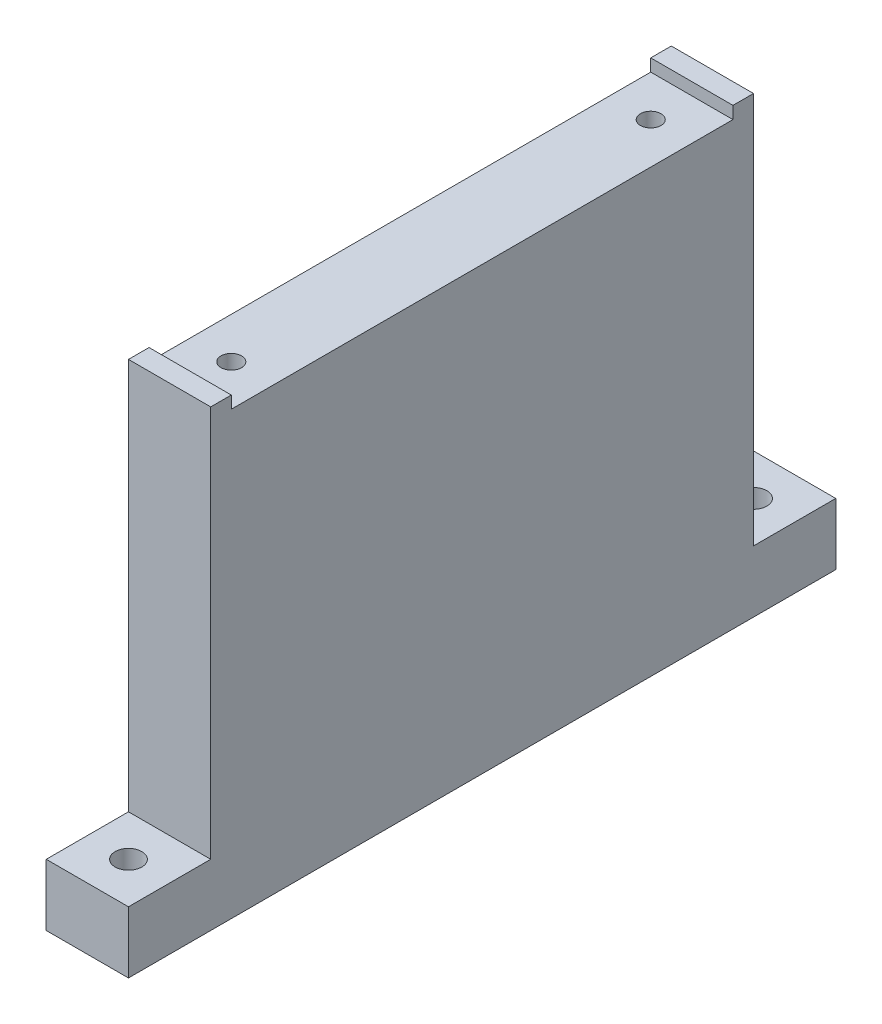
ISO-10303-21;
HEADER;
FILE_DESCRIPTION(('STEP AP214'),'2;1');
FILE_NAME('part.step','',(''),(''),'','','');
FILE_SCHEMA(('AUTOMOTIVE_DESIGN { 1 0 10303 214 1 1 1 1 }'));
ENDSEC;
DATA;
#1=APPLICATION_CONTEXT('core data for automotive mechanical design processes');
#2=APPLICATION_PROTOCOL_DEFINITION('international standard','automotive_design',2000,#1);
#3=PRODUCT_CONTEXT('',#1,'mechanical');
#4=PRODUCT('Part','Part','',(#3));
#5=PRODUCT_RELATED_PRODUCT_CATEGORY('part','',(#4));
#6=PRODUCT_DEFINITION_FORMATION('','',#4);
#7=PRODUCT_DEFINITION_CONTEXT('part definition',#1,'design');
#8=PRODUCT_DEFINITION('design','',#6,#7);
#9=PRODUCT_DEFINITION_SHAPE('','',#8);
#10=(LENGTH_UNIT() NAMED_UNIT(*) SI_UNIT(.MILLI.,.METRE.));
#11=(NAMED_UNIT(*) PLANE_ANGLE_UNIT() SI_UNIT($,.RADIAN.));
#12=(NAMED_UNIT(*) SI_UNIT($,.STERADIAN.) SOLID_ANGLE_UNIT());
#13=UNCERTAINTY_MEASURE_WITH_UNIT(LENGTH_MEASURE(1.E-05),#10,'distance_accuracy_value','');
#14=(GEOMETRIC_REPRESENTATION_CONTEXT(3) GLOBAL_UNCERTAINTY_ASSIGNED_CONTEXT((#13)) GLOBAL_UNIT_ASSIGNED_CONTEXT((#10,
#11,#12)) REPRESENTATION_CONTEXT('',''));
#15=CARTESIAN_POINT('',(0.,0.,0.));
#16=DIRECTION('',(0.,0.,1.));
#17=DIRECTION('',(1.,0.,0.));
#18=AXIS2_PLACEMENT_3D('',#15,#16,#17);
#19=CARTESIAN_POINT('',(20.,0.,172.));
#20=DIRECTION('',(-1.,0.,0.));
#21=DIRECTION('',(0.,0.,1.));
#22=AXIS2_PLACEMENT_3D('',#19,#20,#21);
#23=PLANE('',#22);
#24=DIRECTION('',(0.,1.,0.));
#25=VECTOR('',#24,1.);
#26=CARTESIAN_POINT('',(20.,15.,20.));
#27=LINE('',#26,#25);
#28=CARTESIAN_POINT('',(20.,15.,20.));
#29=VERTEX_POINT('',#28);
#30=CARTESIAN_POINT('',(20.,110.280000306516,20.));
#31=VERTEX_POINT('',#30);
#32=EDGE_CURVE('E224',#29,#31,#27,.T.);
#33=ORIENTED_EDGE('',*,*,#32,.T.);
#34=DIRECTION('',(0.,0.,-1.));
#35=VECTOR('',#34,1.);
#36=CARTESIAN_POINT('',(20.,110.280000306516,172.));
#37=LINE('',#36,#35);
#38=CARTESIAN_POINT('',(20.,110.280000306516,25.));
#39=VERTEX_POINT('',#38);
#40=EDGE_CURVE('E146',#39,#31,#37,.T.);
#41=ORIENTED_EDGE('',*,*,#40,.F.);
#42=DIRECTION('',(0.,-1.,0.));
#43=VECTOR('',#42,1.);
#44=CARTESIAN_POINT('',(20.,107.280000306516,25.));
#45=LINE('',#44,#43);
#46=CARTESIAN_POINT('',(20.,107.280000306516,25.));
#47=VERTEX_POINT('',#46);
#48=EDGE_CURVE('E219',#39,#47,#45,.T.);
#49=ORIENTED_EDGE('',*,*,#48,.T.);
#50=DIRECTION('',(0.,0.,1.));
#51=VECTOR('',#50,1.);
#52=CARTESIAN_POINT('',(20.,107.280000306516,147.));
#53=LINE('',#52,#51);
#54=CARTESIAN_POINT('',(20.,107.280000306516,147.));
#55=VERTEX_POINT('',#54);
#56=EDGE_CURVE('E140',#47,#55,#53,.T.);
#57=ORIENTED_EDGE('',*,*,#56,.T.);
#58=DIRECTION('',(0.,1.,0.));
#59=VECTOR('',#58,1.);
#60=CARTESIAN_POINT('',(20.,107.280000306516,147.));
#61=LINE('',#60,#59);
#62=CARTESIAN_POINT('',(20.,110.280000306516,147.));
#63=VERTEX_POINT('',#62);
#64=EDGE_CURVE('E123',#55,#63,#61,.T.);
#65=ORIENTED_EDGE('',*,*,#64,.T.);
#66=CARTESIAN_POINT('',(20.,110.280000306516,152.));
#67=VERTEX_POINT('',#66);
#68=EDGE_CURVE('E137',#67,#63,#37,.T.);
#69=ORIENTED_EDGE('',*,*,#68,.F.);
#70=DIRECTION('',(0.,-1.,0.));
#71=VECTOR('',#70,1.);
#72=CARTESIAN_POINT('',(20.,15.,152.));
#73=LINE('',#72,#71);
#74=CARTESIAN_POINT('',(20.,15.,152.));
#75=VERTEX_POINT('',#74);
#76=EDGE_CURVE('E141',#67,#75,#73,.T.);
#77=ORIENTED_EDGE('',*,*,#76,.T.);
#78=DIRECTION('',(0.,0.,1.));
#79=VECTOR('',#78,1.);
#80=CARTESIAN_POINT('',(20.,15.,172.));
#81=LINE('',#80,#79);
#82=CARTESIAN_POINT('',(20.,15.,172.));
#83=VERTEX_POINT('',#82);
#84=EDGE_CURVE('E172',#75,#83,#81,.T.);
#85=ORIENTED_EDGE('',*,*,#84,.T.);
#86=DIRECTION('',(0.,1.,0.));
#87=VECTOR('',#86,1.);
#88=CARTESIAN_POINT('',(20.,0.,172.));
#89=LINE('',#88,#87);
#90=CARTESIAN_POINT('',(20.,0.,172.));
#91=VERTEX_POINT('',#90);
#92=EDGE_CURVE('E193',#91,#83,#89,.T.);
#93=ORIENTED_EDGE('',*,*,#92,.F.);
#94=DIRECTION('',(0.,0.,-1.));
#95=VECTOR('',#94,1.);
#96=CARTESIAN_POINT('',(20.,0.,172.));
#97=LINE('',#96,#95);
#98=CARTESIAN_POINT('',(20.,0.,0.));
#99=VERTEX_POINT('',#98);
#100=EDGE_CURVE('E145',#91,#99,#97,.T.);
#101=ORIENTED_EDGE('',*,*,#100,.T.);
#102=DIRECTION('',(0.,1.,0.));
#103=VECTOR('',#102,1.);
#104=CARTESIAN_POINT('',(20.,0.,0.));
#105=LINE('',#104,#103);
#106=CARTESIAN_POINT('',(20.,15.,0.));
#107=VERTEX_POINT('',#106);
#108=EDGE_CURVE('E184',#99,#107,#105,.T.);
#109=ORIENTED_EDGE('',*,*,#108,.T.);
#110=DIRECTION('',(0.,0.,1.));
#111=VECTOR('',#110,1.);
#112=CARTESIAN_POINT('',(20.,15.,20.));
#113=LINE('',#112,#111);
#114=EDGE_CURVE('E226',#107,#29,#113,.T.);
#115=ORIENTED_EDGE('',*,*,#114,.T.);
#116=EDGE_LOOP('',(#33,#41,#49,#57,#65,#69,#77,#85,#93,#101,#109,#115));
#117=FACE_BOUND('',#116,.T.);
#118=ADVANCED_FACE('F33',(#117),#23,.F.);
#119=CARTESIAN_POINT('',(0.,110.280000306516,172.));
#120=DIRECTION('',(0.,-1.,0.));
#121=DIRECTION('',(0.,0.,-1.));
#122=AXIS2_PLACEMENT_3D('',#119,#120,#121);
#123=PLANE('',#122);
#124=DIRECTION('',(1.,0.,0.));
#125=VECTOR('',#124,1.);
#126=CARTESIAN_POINT('',(-152.,110.280000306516,25.));
#127=LINE('',#126,#125);
#128=CARTESIAN_POINT('',(0.,110.280000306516,25.));
#129=VERTEX_POINT('',#128);
#130=EDGE_CURVE('E213',#129,#39,#127,.T.);
#131=ORIENTED_EDGE('',*,*,#130,.T.);
#132=ORIENTED_EDGE('',*,*,#40,.T.);
#133=DIRECTION('',(1.,0.,0.));
#134=VECTOR('',#133,1.);
#135=CARTESIAN_POINT('',(-152.,110.280000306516,20.));
#136=LINE('',#135,#134);
#137=CARTESIAN_POINT('',(0.,110.280000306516,20.));
#138=VERTEX_POINT('',#137);
#139=EDGE_CURVE('E216',#138,#31,#136,.T.);
#140=ORIENTED_EDGE('',*,*,#139,.F.);
#141=DIRECTION('',(0.,0.,-1.));
#142=VECTOR('',#141,1.);
#143=CARTESIAN_POINT('',(0.,110.280000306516,172.));
#144=LINE('',#143,#142);
#145=EDGE_CURVE('E154',#129,#138,#144,.T.);
#146=ORIENTED_EDGE('',*,*,#145,.F.);
#147=EDGE_LOOP('',(#131,#132,#140,#146));
#148=FACE_BOUND('',#147,.T.);
#149=ADVANCED_FACE('F290',(#148),#123,.F.);
#150=DIRECTION('',(1.,0.,0.));
#151=VECTOR('',#150,1.);
#152=CARTESIAN_POINT('',(-152.,110.280000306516,152.));
#153=LINE('',#152,#151);
#154=CARTESIAN_POINT('',(0.,110.280000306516,152.));
#155=VERTEX_POINT('',#154);
#156=EDGE_CURVE('E131',#155,#67,#153,.T.);
#157=ORIENTED_EDGE('',*,*,#156,.T.);
#158=ORIENTED_EDGE('',*,*,#68,.T.);
#159=DIRECTION('',(1.,0.,0.));
#160=VECTOR('',#159,1.);
#161=CARTESIAN_POINT('',(-152.,110.280000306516,147.));
#162=LINE('',#161,#160);
#163=CARTESIAN_POINT('',(0.,110.280000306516,147.));
#164=VERTEX_POINT('',#163);
#165=EDGE_CURVE('E120',#164,#63,#162,.T.);
#166=ORIENTED_EDGE('',*,*,#165,.F.);
#167=EDGE_CURVE('E152',#155,#164,#144,.T.);
#168=ORIENTED_EDGE('',*,*,#167,.F.);
#169=EDGE_LOOP('',(#157,#158,#166,#168));
#170=FACE_BOUND('',#169,.T.);
#171=ADVANCED_FACE('F144',(#170),#123,.F.);
#172=CARTESIAN_POINT('',(0.,0.,172.));
#173=DIRECTION('',(1.,0.,0.));
#174=DIRECTION('',(0.,0.,-1.));
#175=AXIS2_PLACEMENT_3D('',#172,#173,#174);
#176=PLANE('',#175);
#177=DIRECTION('',(0.,1.,0.));
#178=VECTOR('',#177,1.);
#179=CARTESIAN_POINT('',(0.,0.,20.));
#180=LINE('',#179,#178);
#181=CARTESIAN_POINT('',(0.,15.,20.));
#182=VERTEX_POINT('',#181);
#183=EDGE_CURVE('E12',#182,#138,#180,.T.);
#184=ORIENTED_EDGE('',*,*,#183,.F.);
#185=DIRECTION('',(0.,0.,1.));
#186=VECTOR('',#185,1.);
#187=CARTESIAN_POINT('',(0.,15.,172.));
#188=LINE('',#187,#186);
#189=CARTESIAN_POINT('',(0.,15.,0.));
#190=VERTEX_POINT('',#189);
#191=EDGE_CURVE('E181',#190,#182,#188,.T.);
#192=ORIENTED_EDGE('',*,*,#191,.F.);
#193=DIRECTION('',(0.,-1.,0.));
#194=VECTOR('',#193,1.);
#195=CARTESIAN_POINT('',(0.,0.,0.));
#196=LINE('',#195,#194);
#197=CARTESIAN_POINT('',(0.,0.,0.));
#198=VERTEX_POINT('',#197);
#199=EDGE_CURVE('E194',#190,#198,#196,.T.);
#200=ORIENTED_EDGE('',*,*,#199,.T.);
#201=DIRECTION('',(0.,0.,-1.));
#202=VECTOR('',#201,1.);
#203=CARTESIAN_POINT('',(0.,0.,172.));
#204=LINE('',#203,#202);
#205=CARTESIAN_POINT('',(0.,0.,172.));
#206=VERTEX_POINT('',#205);
#207=EDGE_CURVE('E197',#206,#198,#204,.T.);
#208=ORIENTED_EDGE('',*,*,#207,.F.);
#209=DIRECTION('',(0.,-1.,0.));
#210=VECTOR('',#209,1.);
#211=CARTESIAN_POINT('',(0.,0.,172.));
#212=LINE('',#211,#210);
#213=CARTESIAN_POINT('',(0.,15.,172.));
#214=VERTEX_POINT('',#213);
#215=EDGE_CURVE('E179',#214,#206,#212,.T.);
#216=ORIENTED_EDGE('',*,*,#215,.F.);
#217=DIRECTION('',(0.,0.,1.));
#218=VECTOR('',#217,1.);
#219=CARTESIAN_POINT('',(0.,15.,172.));
#220=LINE('',#219,#218);
#221=CARTESIAN_POINT('',(0.,15.,152.));
#222=VERTEX_POINT('',#221);
#223=EDGE_CURVE('E56',#222,#214,#220,.T.);
#224=ORIENTED_EDGE('',*,*,#223,.F.);
#225=DIRECTION('',(0.,-1.,0.));
#226=VECTOR('',#225,1.);
#227=CARTESIAN_POINT('',(0.,0.,152.));
#228=LINE('',#227,#226);
#229=EDGE_CURVE('E41',#155,#222,#228,.T.);
#230=ORIENTED_EDGE('',*,*,#229,.F.);
#231=ORIENTED_EDGE('',*,*,#167,.T.);
#232=DIRECTION('',(0.,1.,0.));
#233=VECTOR('',#232,1.);
#234=CARTESIAN_POINT('',(0.,0.,147.));
#235=LINE('',#234,#233);
#236=CARTESIAN_POINT('',(0.,107.280000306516,147.));
#237=VERTEX_POINT('',#236);
#238=EDGE_CURVE('E126',#237,#164,#235,.T.);
#239=ORIENTED_EDGE('',*,*,#238,.F.);
#240=DIRECTION('',(0.,0.,1.));
#241=VECTOR('',#240,1.);
#242=CARTESIAN_POINT('',(0.,107.280000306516,172.));
#243=LINE('',#242,#241);
#244=CARTESIAN_POINT('',(0.,107.280000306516,25.));
#245=VERTEX_POINT('',#244);
#246=EDGE_CURVE('E161',#245,#237,#243,.T.);
#247=ORIENTED_EDGE('',*,*,#246,.F.);
#248=DIRECTION('',(0.,-1.,0.));
#249=VECTOR('',#248,1.);
#250=CARTESIAN_POINT('',(0.,0.,25.));
#251=LINE('',#250,#249);
#252=EDGE_CURVE('E163',#129,#245,#251,.T.);
#253=ORIENTED_EDGE('',*,*,#252,.F.);
#254=ORIENTED_EDGE('',*,*,#145,.T.);
#255=EDGE_LOOP('',(#184,#192,#200,#208,#216,#224,#230,#231,#239,#247,#253,#254));
#256=FACE_BOUND('',#255,.T.);
#257=ADVANCED_FACE('F177',(#256),#176,.F.);
#258=CARTESIAN_POINT('',(20.,0.,172.));
#259=DIRECTION('',(0.,0.,1.));
#260=DIRECTION('',(1.,0.,0.));
#261=AXIS2_PLACEMENT_3D('',#258,#259,#260);
#262=PLANE('',#261);
#263=ORIENTED_EDGE('',*,*,#92,.T.);
#264=DIRECTION('',(-1.,0.,0.));
#265=VECTOR('',#264,1.);
#266=CARTESIAN_POINT('',(20.,15.,172.));
#267=LINE('',#266,#265);
#268=EDGE_CURVE('E158',#83,#214,#267,.T.);
#269=ORIENTED_EDGE('',*,*,#268,.T.);
#270=ORIENTED_EDGE('',*,*,#215,.T.);
#271=DIRECTION('',(1.,0.,0.));
#272=VECTOR('',#271,1.);
#273=CARTESIAN_POINT('',(0.,0.,172.));
#274=LINE('',#273,#272);
#275=EDGE_CURVE('E190',#206,#91,#274,.T.);
#276=ORIENTED_EDGE('',*,*,#275,.T.);
#277=EDGE_LOOP('',(#263,#269,#270,#276));
#278=FACE_BOUND('',#277,.T.);
#279=ADVANCED_FACE('F299',(#278),#262,.T.);
#280=CARTESIAN_POINT('',(20.,0.,0.));
#281=DIRECTION('',(0.,0.,1.));
#282=DIRECTION('',(1.,0.,0.));
#283=AXIS2_PLACEMENT_3D('',#280,#281,#282);
#284=PLANE('',#283);
#285=DIRECTION('',(-1.,0.,0.));
#286=VECTOR('',#285,1.);
#287=CARTESIAN_POINT('',(20.,15.,0.));
#288=LINE('',#287,#286);
#289=EDGE_CURVE('E149',#107,#190,#288,.T.);
#290=ORIENTED_EDGE('',*,*,#289,.F.);
#291=ORIENTED_EDGE('',*,*,#108,.F.);
#292=DIRECTION('',(1.,0.,0.));
#293=VECTOR('',#292,1.);
#294=CARTESIAN_POINT('',(0.,0.,0.));
#295=LINE('',#294,#293);
#296=EDGE_CURVE('E180',#198,#99,#295,.T.);
#297=ORIENTED_EDGE('',*,*,#296,.F.);
#298=ORIENTED_EDGE('',*,*,#199,.F.);
#299=EDGE_LOOP('',(#290,#291,#297,#298));
#300=FACE_BOUND('',#299,.T.);
#301=ADVANCED_FACE('F300',(#300),#284,.F.);
#302=CARTESIAN_POINT('',(0.,0.,172.));
#303=DIRECTION('',(0.,1.,0.));
#304=DIRECTION('',(0.,0.,1.));
#305=AXIS2_PLACEMENT_3D('',#302,#303,#304);
#306=PLANE('',#305);
#307=CARTESIAN_POINT('',(10.,0.,162.));
#308=DIRECTION('',(0.,1.,0.));
#309=DIRECTION('',(0.,0.,1.));
#310=AXIS2_PLACEMENT_3D('',#307,#308,#309);
#311=CIRCLE('',#310,3.25);
#312=CARTESIAN_POINT('',(10.,0.,165.25));
#313=VERTEX_POINT('',#312);
#314=EDGE_CURVE('E240',#313,#313,#311,.T.);
#315=ORIENTED_EDGE('',*,*,#314,.T.);
#316=EDGE_LOOP('',(#315));
#317=FACE_BOUND('',#316,.T.);
#318=CARTESIAN_POINT('',(10.,0.,10.));
#319=DIRECTION('',(0.,1.,0.));
#320=DIRECTION('',(0.,0.,1.));
#321=AXIS2_PLACEMENT_3D('',#318,#319,#320);
#322=CIRCLE('',#321,3.25);
#323=CARTESIAN_POINT('',(10.,0.,13.25));
#324=VERTEX_POINT('',#323);
#325=EDGE_CURVE('E234',#324,#324,#322,.T.);
#326=ORIENTED_EDGE('',*,*,#325,.T.);
#327=EDGE_LOOP('',(#326));
#328=FACE_BOUND('',#327,.T.);
#329=ORIENTED_EDGE('',*,*,#296,.T.);
#330=ORIENTED_EDGE('',*,*,#100,.F.);
#331=ORIENTED_EDGE('',*,*,#275,.F.);
#332=ORIENTED_EDGE('',*,*,#207,.T.);
#333=EDGE_LOOP('',(#329,#330,#331,#332));
#334=FACE_BOUND('',#333,.T.);
#335=ADVANCED_FACE('F35',(#317,#328,#334),#306,.F.);
#336=CARTESIAN_POINT('',(-152.,15.,20.));
#337=DIRECTION('',(0.,1.,0.));
#338=DIRECTION('',(0.,0.,1.));
#339=AXIS2_PLACEMENT_3D('',#336,#337,#338);
#340=PLANE('',#339);
#341=CARTESIAN_POINT('',(10.,15.,10.));
#342=DIRECTION('',(0.,1.,0.));
#343=DIRECTION('',(0.,0.,1.));
#344=AXIS2_PLACEMENT_3D('',#341,#342,#343);
#345=CIRCLE('',#344,3.25);
#346=CARTESIAN_POINT('',(10.,15.,13.25));
#347=VERTEX_POINT('',#346);
#348=EDGE_CURVE('E237',#347,#347,#345,.T.);
#349=ORIENTED_EDGE('',*,*,#348,.F.);
#350=EDGE_LOOP('',(#349));
#351=FACE_BOUND('',#350,.T.);
#352=ORIENTED_EDGE('',*,*,#191,.T.);
#353=DIRECTION('',(1.,0.,0.));
#354=VECTOR('',#353,1.);
#355=CARTESIAN_POINT('',(-152.,15.,20.));
#356=LINE('',#355,#354);
#357=EDGE_CURVE('E173',#182,#29,#356,.T.);
#358=ORIENTED_EDGE('',*,*,#357,.T.);
#359=ORIENTED_EDGE('',*,*,#114,.F.);
#360=ORIENTED_EDGE('',*,*,#289,.T.);
#361=EDGE_LOOP('',(#352,#358,#359,#360));
#362=FACE_BOUND('',#361,.T.);
#363=ADVANCED_FACE('F315',(#351,#362),#340,.T.);
#364=CARTESIAN_POINT('',(-152.,15.,20.));
#365=DIRECTION('',(0.,0.,-1.));
#366=DIRECTION('',(-1.,0.,0.));
#367=AXIS2_PLACEMENT_3D('',#364,#365,#366);
#368=PLANE('',#367);
#369=ORIENTED_EDGE('',*,*,#183,.T.);
#370=ORIENTED_EDGE('',*,*,#139,.T.);
#371=ORIENTED_EDGE('',*,*,#32,.F.);
#372=ORIENTED_EDGE('',*,*,#357,.F.);
#373=EDGE_LOOP('',(#369,#370,#371,#372));
#374=FACE_BOUND('',#373,.T.);
#375=ADVANCED_FACE('F313',(#374),#368,.T.);
#376=CARTESIAN_POINT('',(-152.,15.,172.));
#377=DIRECTION('',(0.,1.,0.));
#378=DIRECTION('',(0.,0.,1.));
#379=AXIS2_PLACEMENT_3D('',#376,#377,#378);
#380=PLANE('',#379);
#381=CARTESIAN_POINT('',(10.,15.,162.));
#382=DIRECTION('',(0.,1.,0.));
#383=DIRECTION('',(0.,0.,1.));
#384=AXIS2_PLACEMENT_3D('',#381,#382,#383);
#385=CIRCLE('',#384,3.25);
#386=CARTESIAN_POINT('',(10.,15.,165.25));
#387=VERTEX_POINT('',#386);
#388=EDGE_CURVE('E243',#387,#387,#385,.T.);
#389=ORIENTED_EDGE('',*,*,#388,.F.);
#390=EDGE_LOOP('',(#389));
#391=FACE_BOUND('',#390,.T.);
#392=ORIENTED_EDGE('',*,*,#223,.T.);
#393=ORIENTED_EDGE('',*,*,#268,.F.);
#394=ORIENTED_EDGE('',*,*,#84,.F.);
#395=DIRECTION('',(1.,0.,0.));
#396=VECTOR('',#395,1.);
#397=CARTESIAN_POINT('',(-152.,15.,152.));
#398=LINE('',#397,#396);
#399=EDGE_CURVE('E167',#222,#75,#398,.T.);
#400=ORIENTED_EDGE('',*,*,#399,.F.);
#401=EDGE_LOOP('',(#392,#393,#394,#400));
#402=FACE_BOUND('',#401,.T.);
#403=ADVANCED_FACE('F170',(#391,#402),#380,.T.);
#404=CARTESIAN_POINT('',(-152.,15.,152.));
#405=DIRECTION('',(0.,0.,1.));
#406=DIRECTION('',(1.,0.,0.));
#407=AXIS2_PLACEMENT_3D('',#404,#405,#406);
#408=PLANE('',#407);
#409=ORIENTED_EDGE('',*,*,#229,.T.);
#410=ORIENTED_EDGE('',*,*,#399,.T.);
#411=ORIENTED_EDGE('',*,*,#76,.F.);
#412=ORIENTED_EDGE('',*,*,#156,.F.);
#413=EDGE_LOOP('',(#409,#410,#411,#412));
#414=FACE_BOUND('',#413,.T.);
#415=ADVANCED_FACE('F166',(#414),#408,.T.);
#416=CARTESIAN_POINT('',(-152.,107.280000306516,147.));
#417=DIRECTION('',(0.,1.,0.));
#418=DIRECTION('',(0.,0.,1.));
#419=AXIS2_PLACEMENT_3D('',#416,#417,#418);
#420=PLANE('',#419);
#421=CARTESIAN_POINT('',(10.,107.280000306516,137.));
#422=DIRECTION('',(0.,1.,0.));
#423=DIRECTION('',(0.,0.,1.));
#424=AXIS2_PLACEMENT_3D('',#421,#422,#423);
#425=CIRCLE('',#424,2.5);
#426=CARTESIAN_POINT('',(10.,107.280000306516,139.5));
#427=VERTEX_POINT('',#426);
#428=EDGE_CURVE('E253',#427,#427,#425,.T.);
#429=ORIENTED_EDGE('',*,*,#428,.F.);
#430=EDGE_LOOP('',(#429));
#431=FACE_BOUND('',#430,.T.);
#432=CARTESIAN_POINT('',(10.,107.280000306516,35.));
#433=DIRECTION('',(0.,1.,0.));
#434=DIRECTION('',(0.,0.,1.));
#435=AXIS2_PLACEMENT_3D('',#432,#433,#434);
#436=CIRCLE('',#435,2.5);
#437=CARTESIAN_POINT('',(10.,107.280000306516,37.5));
#438=VERTEX_POINT('',#437);
#439=EDGE_CURVE('E247',#438,#438,#436,.T.);
#440=ORIENTED_EDGE('',*,*,#439,.F.);
#441=EDGE_LOOP('',(#440));
#442=FACE_BOUND('',#441,.T.);
#443=ORIENTED_EDGE('',*,*,#246,.T.);
#444=DIRECTION('',(1.,0.,0.));
#445=VECTOR('',#444,1.);
#446=CARTESIAN_POINT('',(-152.,107.280000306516,147.));
#447=LINE('',#446,#445);
#448=EDGE_CURVE('E48',#237,#55,#447,.T.);
#449=ORIENTED_EDGE('',*,*,#448,.T.);
#450=ORIENTED_EDGE('',*,*,#56,.F.);
#451=DIRECTION('',(1.,0.,0.));
#452=VECTOR('',#451,1.);
#453=CARTESIAN_POINT('',(-152.,107.280000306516,25.));
#454=LINE('',#453,#452);
#455=EDGE_CURVE('E186',#245,#47,#454,.T.);
#456=ORIENTED_EDGE('',*,*,#455,.F.);
#457=EDGE_LOOP('',(#443,#449,#450,#456));
#458=FACE_BOUND('',#457,.T.);
#459=ADVANCED_FACE('F211',(#431,#442,#458),#420,.T.);
#460=CARTESIAN_POINT('',(-152.,107.280000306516,25.));
#461=DIRECTION('',(0.,0.,1.));
#462=DIRECTION('',(1.,0.,0.));
#463=AXIS2_PLACEMENT_3D('',#460,#461,#462);
#464=PLANE('',#463);
#465=ORIENTED_EDGE('',*,*,#252,.T.);
#466=ORIENTED_EDGE('',*,*,#455,.T.);
#467=ORIENTED_EDGE('',*,*,#48,.F.);
#468=ORIENTED_EDGE('',*,*,#130,.F.);
#469=EDGE_LOOP('',(#465,#466,#467,#468));
#470=FACE_BOUND('',#469,.T.);
#471=ADVANCED_FACE('F270',(#470),#464,.T.);
#472=CARTESIAN_POINT('',(-152.,107.280000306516,147.));
#473=DIRECTION('',(0.,0.,-1.));
#474=DIRECTION('',(-1.,0.,0.));
#475=AXIS2_PLACEMENT_3D('',#472,#473,#474);
#476=PLANE('',#475);
#477=ORIENTED_EDGE('',*,*,#238,.T.);
#478=ORIENTED_EDGE('',*,*,#165,.T.);
#479=ORIENTED_EDGE('',*,*,#64,.F.);
#480=ORIENTED_EDGE('',*,*,#448,.F.);
#481=EDGE_LOOP('',(#477,#478,#479,#480));
#482=FACE_BOUND('',#481,.T.);
#483=ADVANCED_FACE('F122',(#482),#476,.T.);
#484=CARTESIAN_POINT('',(10.,-157.,10.));
#485=DIRECTION('',(0.,1.,0.));
#486=DIRECTION('',(0.,0.,1.));
#487=AXIS2_PLACEMENT_3D('',#484,#485,#486);
#488=CYLINDRICAL_SURFACE('',#487,3.25);
#489=ORIENTED_EDGE('',*,*,#348,.T.);
#490=EDGE_LOOP('',(#489));
#491=FACE_BOUND('',#490,.T.);
#492=ORIENTED_EDGE('',*,*,#325,.F.);
#493=EDGE_LOOP('',(#492));
#494=FACE_BOUND('',#493,.T.);
#495=ADVANCED_FACE('F285',(#491,#494),#488,.F.);
#496=CARTESIAN_POINT('',(10.,-157.,162.));
#497=DIRECTION('',(0.,1.,0.));
#498=DIRECTION('',(0.,0.,1.));
#499=AXIS2_PLACEMENT_3D('',#496,#497,#498);
#500=CYLINDRICAL_SURFACE('',#499,3.25);
#501=ORIENTED_EDGE('',*,*,#388,.T.);
#502=EDGE_LOOP('',(#501));
#503=FACE_BOUND('',#502,.T.);
#504=ORIENTED_EDGE('',*,*,#314,.F.);
#505=EDGE_LOOP('',(#504));
#506=FACE_BOUND('',#505,.T.);
#507=ADVANCED_FACE('F276',(#503,#506),#500,.F.);
#508=CARTESIAN_POINT('',(10.,82.2800003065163,35.));
#509=DIRECTION('',(0.,1.,0.));
#510=DIRECTION('',(0.,0.,1.));
#511=AXIS2_PLACEMENT_3D('',#508,#509,#510);
#512=CYLINDRICAL_SURFACE('',#511,2.5);
#513=CARTESIAN_POINT('',(10.,82.2800003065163,35.));
#514=DIRECTION('',(0.,1.,0.));
#515=DIRECTION('',(0.,0.,1.));
#516=AXIS2_PLACEMENT_3D('',#513,#514,#515);
#517=CIRCLE('',#516,2.5);
#518=CARTESIAN_POINT('',(10.,82.2800003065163,37.5));
#519=VERTEX_POINT('',#518);
#520=EDGE_CURVE('E246',#519,#519,#517,.T.);
#521=ORIENTED_EDGE('',*,*,#520,.F.);
#522=EDGE_LOOP('',(#521));
#523=FACE_BOUND('',#522,.T.);
#524=ORIENTED_EDGE('',*,*,#439,.T.);
#525=EDGE_LOOP('',(#524));
#526=FACE_BOUND('',#525,.T.);
#527=ADVANCED_FACE('F274',(#523,#526),#512,.F.);
#528=CARTESIAN_POINT('',(10.,82.2800003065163,35.));
#529=DIRECTION('',(0.,1.,0.));
#530=DIRECTION('',(0.,0.,1.));
#531=AXIS2_PLACEMENT_3D('',#528,#529,#530);
#532=PLANE('',#531);
#533=ORIENTED_EDGE('',*,*,#520,.T.);
#534=EDGE_LOOP('',(#533));
#535=FACE_BOUND('',#534,.T.);
#536=ADVANCED_FACE('F264',(#535),#532,.T.);
#537=CARTESIAN_POINT('',(10.,82.2800003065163,137.));
#538=DIRECTION('',(0.,1.,0.));
#539=DIRECTION('',(0.,0.,1.));
#540=AXIS2_PLACEMENT_3D('',#537,#538,#539);
#541=CYLINDRICAL_SURFACE('',#540,2.5);
#542=CARTESIAN_POINT('',(10.,82.2800003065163,137.));
#543=DIRECTION('',(0.,1.,0.));
#544=DIRECTION('',(0.,0.,1.));
#545=AXIS2_PLACEMENT_3D('',#542,#543,#544);
#546=CIRCLE('',#545,2.5);
#547=CARTESIAN_POINT('',(10.,82.2800003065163,139.5));
#548=VERTEX_POINT('',#547);
#549=EDGE_CURVE('E250',#548,#548,#546,.T.);
#550=ORIENTED_EDGE('',*,*,#549,.F.);
#551=EDGE_LOOP('',(#550));
#552=FACE_BOUND('',#551,.T.);
#553=ORIENTED_EDGE('',*,*,#428,.T.);
#554=EDGE_LOOP('',(#553));
#555=FACE_BOUND('',#554,.T.);
#556=ADVANCED_FACE('F261',(#552,#555),#541,.F.);
#557=CARTESIAN_POINT('',(10.,82.2800003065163,137.));
#558=DIRECTION('',(0.,1.,0.));
#559=DIRECTION('',(0.,0.,1.));
#560=AXIS2_PLACEMENT_3D('',#557,#558,#559);
#561=PLANE('',#560);
#562=ORIENTED_EDGE('',*,*,#549,.T.);
#563=EDGE_LOOP('',(#562));
#564=FACE_BOUND('',#563,.T.);
#565=ADVANCED_FACE('F259',(#564),#561,.T.);
#566=CLOSED_SHELL('',(#118,#149,#171,#257,#279,#301,#335,#363,#375,#403,#415,#459,#471,#483,
#495,#507,#527,#536,#556,#565));
#567=MANIFOLD_SOLID_BREP('B2',#566);
#568=ADVANCED_BREP_SHAPE_REPRESENTATION('',(#18,#567),#14);
#569=SHAPE_DEFINITION_REPRESENTATION(#9,#568);
ENDSEC;
END-ISO-10303-21;
